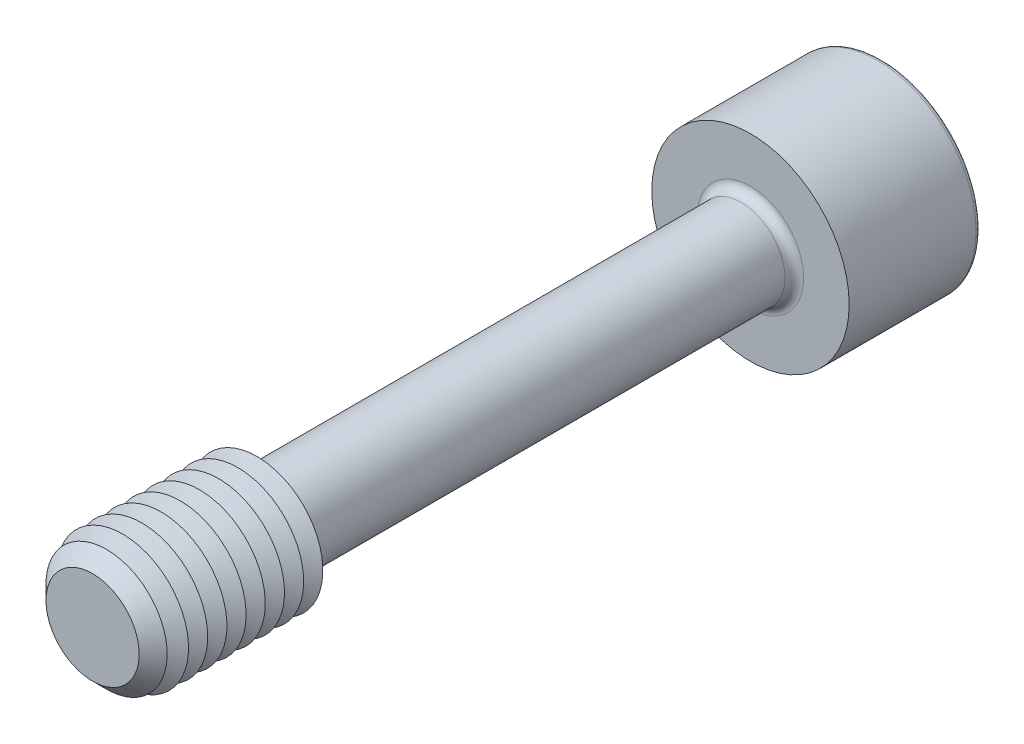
from build123d import *

# Parameters (mm, degrees)
SKETCH1_R       = 4
EXTRUDE1_DEPTH  = 30
CHAMFER1_SIZE   = 1.75
SKETCH3_R       = 9
EXTRUDE2_DEPTH  = 12
EXTRUDE3_DEPTH  = 10
FILLET1_R       = 0.85
FILLET2_R       = 0.425
LPATTERN1_COUNT = 8
LPATTERN1_PITCH = 1.75


with BuildPart() as part:
    # Sketch1 → Extrude1 (new, symmetric)
    with BuildSketch(Plane.XY):
        Circle(SKETCH1_R)
    extrude(amount=EXTRUDE1_DEPTH, both=True)

    # Sketch2 → Revolve1 (revolve)
    with BuildSketch(Plane(origin=(0, 0, 0), x_dir=(0, 0, -1), z_dir=(1, 0, 0))):
        Polygon((-30, 0), (-30, 6), (-15, 6), (-13.845299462, 4), (-13.845299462, 0), align=None)
    revolve(axis=Axis((0, 0, 13.845299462), (0, 0, 1)))

    # Chamfer1
    chamfer1_edges = [part.edges().sort_by_distance(p)[0] for p in [
        (0, -6, 30),
    ]]
    chamfer(chamfer1_edges, length=CHAMFER1_SIZE)

    # Sketch3 → Extrude2 (add)
    with BuildSketch(Plane(origin=(0, 0, -30), x_dir=(-1, 0, 0), z_dir=(0, 0, -1))):
        Circle(SKETCH3_R)
    extrude(amount=EXTRUDE2_DEPTH)

    # Sketch4 → Extrude3 (cut)
    with BuildSketch(Plane(origin=(-13.7, 0, -42), x_dir=(1, 0, 0), z_dir=(0, 0, 1))):
        Polygon((10.813248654, -5), (16.586751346, -5), (19.473502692, 0), (16.586751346, 5), (10.813248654, 5), (7.926497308, 0), align=None)
    extrude(amount=EXTRUDE3_DEPTH, mode=Mode.SUBTRACT)

    # Fillet1
    fillet1_edges = [part.edges().sort_by_distance(p)[0] for p in [
        (-4, 0, -30),
    ]]
    fillet(fillet1_edges, radius=FILLET1_R)

    # Fillet2
    fillet2_edges = [part.edges().sort_by_distance(p)[0] for p in [
        (9, 0, -42),
    ]]
    fillet(fillet2_edges, radius=FILLET2_R)

    # Sketch5 → Cut-Revolve1 (revolve, cut)
    with BuildSketch(Plane(origin=(0, 0, 0), x_dir=(0, 0, -1), z_dir=(1, 0, 0)), mode=Mode.PRIVATE) as cut_revolve1_sk:
        Polygon((32, 0), (32, -5), (29.113248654, 0), align=None)
    revolve(cut_revolve1_sk.sketch.rotate(Axis((0, 0, -29.113248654), (0, 0, -1)), 90), axis=Axis((0, 0, -29.113248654), (0, 0, -1)), mode=Mode.SUBTRACT)

    # Sketch7 → Cut-Revolve2 (revolve, cut)
    with BuildSketch(Plane(origin=(0, 0, 0), x_dir=(0, 0, -1), z_dir=(1, 0, 0)), mode=Mode.PRIVATE) as cut_revolve2_sk:
        Polygon((-15, 6), (-15.875, 4.484455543), (-16.75, 6), align=None)
    cut_revolve2 = revolve(cut_revolve2_sk.sketch.rotate(Axis((0, 0, -1.332048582), (0, 0, 1)), 90), axis=Axis((0, 0, -1.332048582), (0, 0, 1)), mode=Mode.SUBTRACT)

    # LPattern1: Cut-Revolve2 ×8
    with Locations(*[(0, 0, i * LPATTERN1_PITCH) for i in range(1, LPATTERN1_COUNT)]):
        add(cut_revolve2, mode=Mode.SUBTRACT)


solid = part.part
